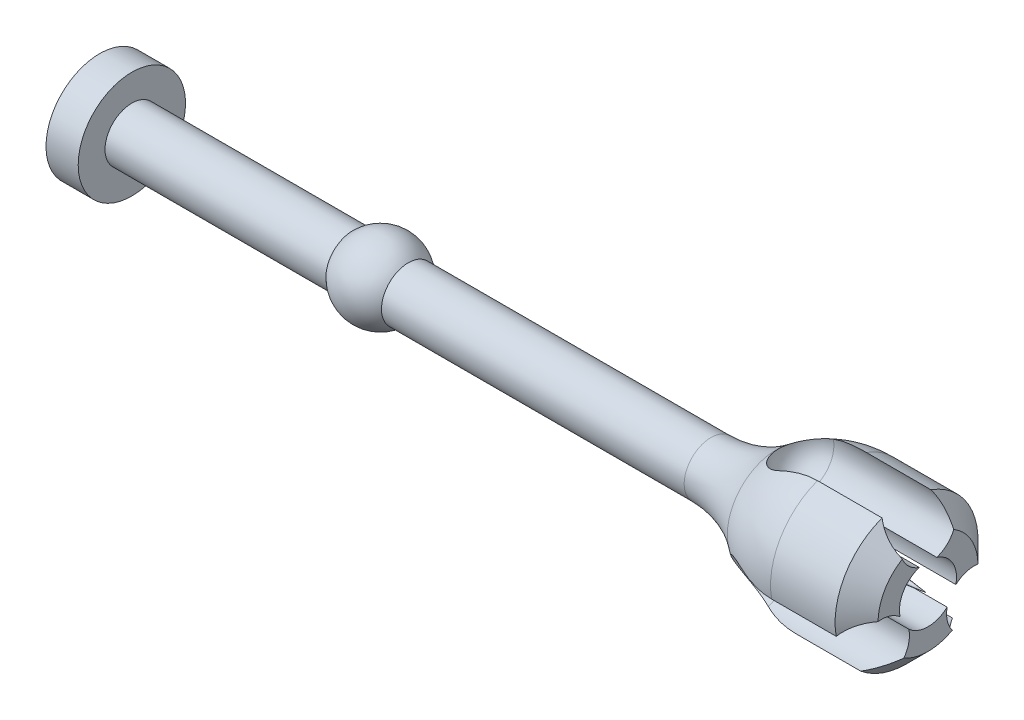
from build123d import *

# Parameters (mm, degrees)
R_P_TITION_CIRCULAIRE1_COUNT = 3


with BuildPart() as part:
    # Esquisse1 → Base-R_volution (revolve)
    with BuildSketch(Plane.XY, mode=Mode.PRIVATE) as base_r_volution_sk:
        with BuildLine():
            Line((-250.904378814, 12.5), (-250.904378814, 25))
            Line((-250.904378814, 25), (-265.904378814, 25))
            Line((-265.904378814, 25), (-265.904378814, 3.341254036))
            Line((-265.904378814, 3.341254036), (-276.902975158, 0))
            Line((-276.902975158, 0), (-260.336618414, 0))
            Line((-260.336618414, 0), (52.944413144, 0))
            Line((52.944413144, 0), (119.139924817, 0))
            Line((119.139924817, 0), (52.944413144, 7.948060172))
            Line((52.944413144, 7.948060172), (52.944413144, 13.294030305))
            Line((52.944413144, 13.294030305), (120.083005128, 13.294030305))
            Line((120.083005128, 13.294030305), (120.083005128, 23.294030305))
            Line((120.083005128, 23.294030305), (110.083005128, 33.294030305))
            Line((110.083005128, 33.294030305), (80, 33.294030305))
            ThreePointArc((80, 33.294030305), (63.877798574, 30.623456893), (49.477818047, 22.897015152))
            ThreePointArc((49.477818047, 22.897015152), (35.07783752, 15.170573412), (18.955636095, 12.5))
            Line((18.955636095, 12.5), (-122.08195502, 12.5))
            ThreePointArc((-122.08195502, 12.5), (-135.033788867, 18), (-147.985622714, 12.5))
            Line((-147.985622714, 12.5), (-250.904378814, 12.5))
        make_face()
    revolve(base_r_volution_sk.sketch.rotate(Axis((-149.337642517, 0, 0), (1, 0, 0)), 90), axis=Axis((-149.337642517, 0, 0), (1, 0, 0)))

    # Esquisse3 → Enlever de la mati_re-R_volution1 (revolve, cut)
    with BuildSketch(Plane.XY):
        with BuildLine():
            Line((122.446258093, 25), (122.446258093, 38))
            Line((122.446258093, 38), (63.220391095, 38))
            ThreePointArc((63.220391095, 38), (54.028002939, 34.192388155), (50.220391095, 25))
            Line((50.220391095, 25), (122.446258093, 25))
        make_face()
    enlever_de_la_mati_re_r_volution1 = revolve(axis=Axis((40.642574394, 25, 0), (1, 0, 0)), mode=Mode.SUBTRACT)

    # R_p_tition circulaire1: Enlever de la mati_re-R_volution1 ×3 about axis
    r_p_tition_circulaire1_axis = Axis((0, 0, 0), (1, 0, 0))
    for i in range(1, R_P_TITION_CIRCULAIRE1_COUNT):
        add(enlever_de_la_mati_re_r_volution1.rotate(r_p_tition_circulaire1_axis, i * 360 / R_P_TITION_CIRCULAIRE1_COUNT), mode=Mode.SUBTRACT)


solid = part.part
